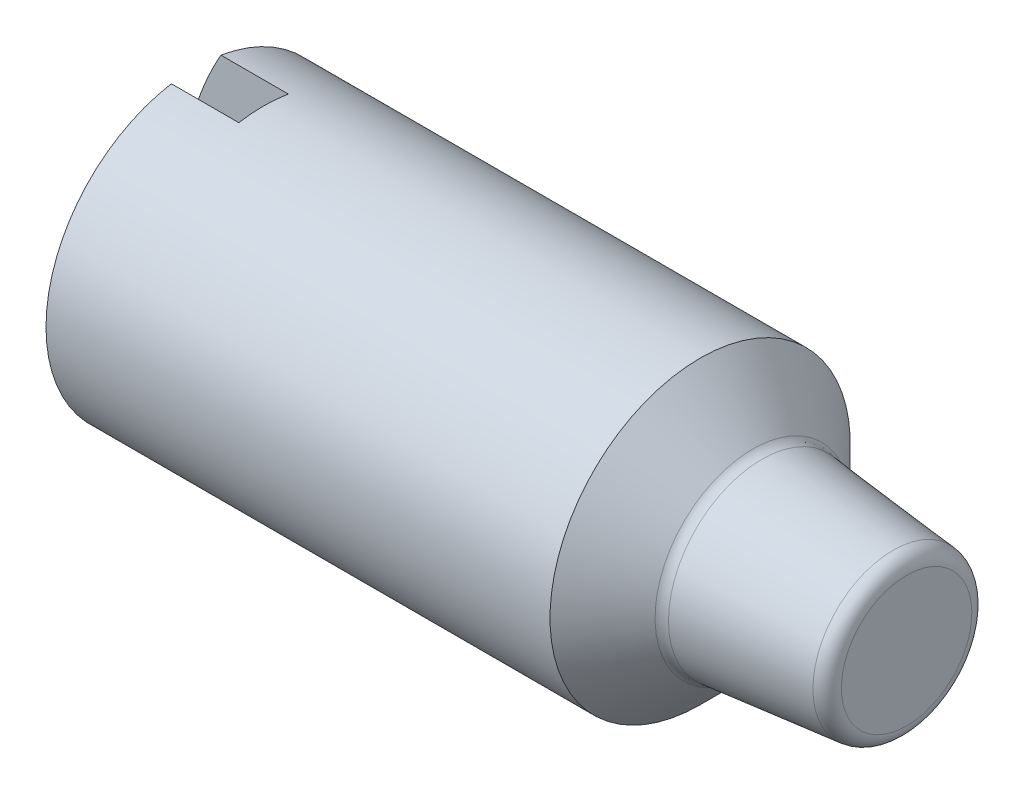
from build123d import *

# Parameters (mm, degrees)
NOTCH_DEPTH      = 11.392304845
NOTCH_DEPTH_BACK = 11.392304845
FILLET_2_R       = 0.2


with BuildPart() as part:
    # Sketch1 → Base (revolve)
    with BuildSketch(Plane.XY, mode=Mode.PRIVATE) as base_sk:
        with BuildLine():
            Line((10, 0), (0, 0))
            ThreePointArc((0, 0), (0.136296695, 1.03527618), (0.535898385, 2))
            Line((0.535898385, 2), (7.25, 2))
            Line((7.25, 2), (8, 1.25))
            Line((8, 1.25), (10, 1.05))
            Line((10, 1.05), (10, 0))
        make_face()
    revolve(base_sk.sketch.rotate(Axis((-8.57033571, 0, 0), (1, 0, 0)), 180), axis=Axis((-8.57033571, 0, 0), (1, 0, 0)))

    # Sketch2 → Notch (cut, two sides: drawn at the far end of the back side and taken through both)
    with BuildSketch(Plane(origin=(0, 0, 0), x_dir=(1, 0, 0), z_dir=(0, 1, 0)).offset(-NOTCH_DEPTH_BACK)):
        with BuildLine():
            Line((1.433635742, 0.33), (0.013635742, 0.33))
            ThreePointArc((0.013635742, 0.33), (-0.316364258, 0), (0.013635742, -0.33))
            Line((0.013635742, -0.33), (1.433635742, -0.33))
            Line((1.433635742, -0.33), (1.433635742, 0.33))
        make_face()
    extrude(amount=NOTCH_DEPTH + NOTCH_DEPTH_BACK, mode=Mode.SUBTRACT)

    # Fillet 2
    fillet_2_edges = [part.edges().sort_by_distance(p)[0] for p in [
        (8, 1.25, 0),
        (10, 1.05, 0),
    ]]
    fillet(fillet_2_edges, radius=FILLET_2_R)


solid = part.part
